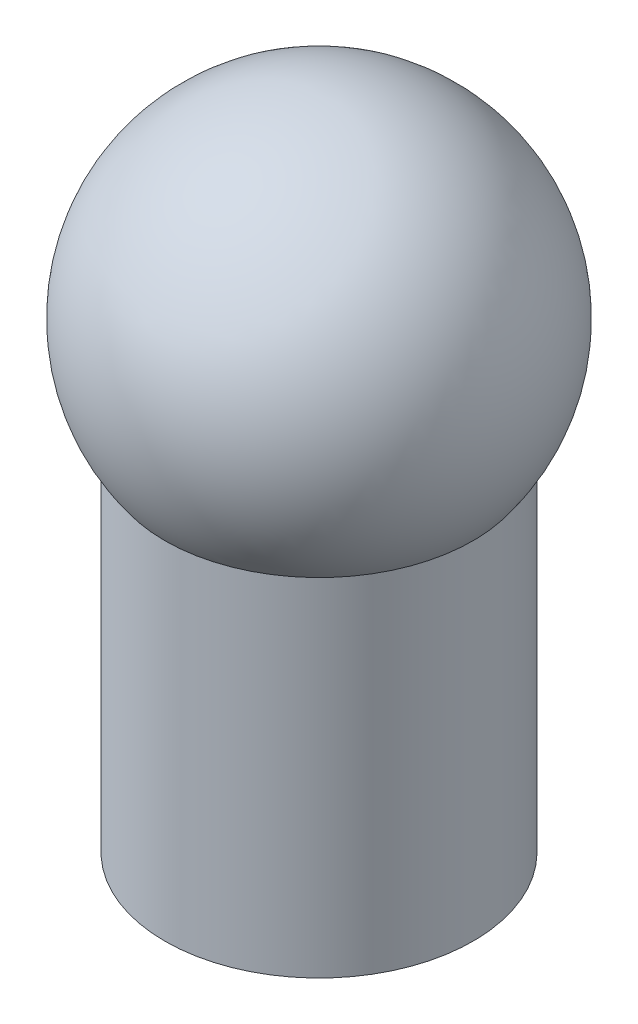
from build123d import *

# Parameters (mm, degrees)
CROQUIS3_R              = 4
SALIENTE_EXTRUIR1_DEPTH = 12


with BuildPart() as part:
    # Croquis2 → Revoluci_n1 (revolve)
    with BuildSketch(Plane(origin=(0, 0, 0), x_dir=(1, 0, 0), z_dir=(0, 1, 0))):
        with BuildLine():
            Line((0, 5), (0, -5))
            ThreePointArc((0, -5), (5, 0), (0, 5))
        make_face()
    revolve(axis=Axis((0, 0, -5), (0, 0, 1)))

    # Croquis3 → Saliente-Extruir1 (add)
    with BuildSketch(Plane(origin=(0, 0, 0), x_dir=(1, 0, 0), z_dir=(0, 1, 0))):
        with Locations(Location((0, 0, 0), (0, 0, 270))):
            Circle(CROQUIS3_R)
    extrude(amount=-SALIENTE_EXTRUIR1_DEPTH)


solid = part.part
